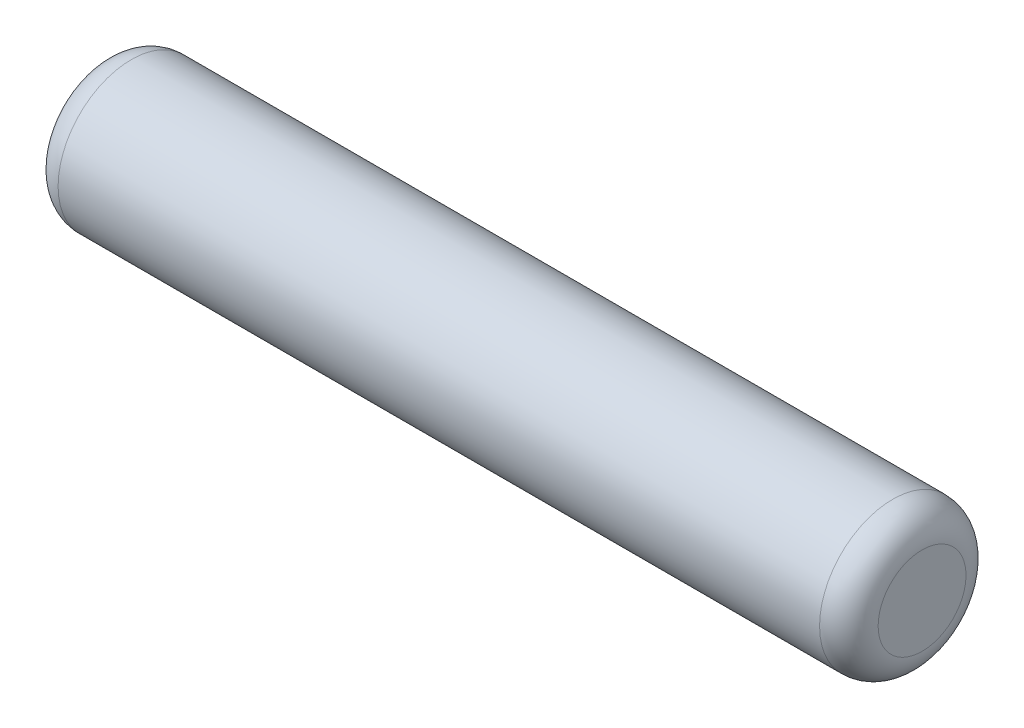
ISO-10303-21;
HEADER;
FILE_DESCRIPTION(('STEP AP214'),'2;1');
FILE_NAME('part.step','',(''),(''),'','','');
FILE_SCHEMA(('AUTOMOTIVE_DESIGN { 1 0 10303 214 1 1 1 1 }'));
ENDSEC;
DATA;
#1=APPLICATION_CONTEXT('core data for automotive mechanical design processes');
#2=APPLICATION_PROTOCOL_DEFINITION('international standard','automotive_design',2000,#1);
#3=PRODUCT_CONTEXT('',#1,'mechanical');
#4=PRODUCT('Part','Part','',(#3));
#5=PRODUCT_RELATED_PRODUCT_CATEGORY('part','',(#4));
#6=PRODUCT_DEFINITION_FORMATION('','',#4);
#7=PRODUCT_DEFINITION_CONTEXT('part definition',#1,'design');
#8=PRODUCT_DEFINITION('design','',#6,#7);
#9=PRODUCT_DEFINITION_SHAPE('','',#8);
#10=(LENGTH_UNIT() NAMED_UNIT(*) SI_UNIT(.MILLI.,.METRE.));
#11=(NAMED_UNIT(*) PLANE_ANGLE_UNIT() SI_UNIT($,.RADIAN.));
#12=(NAMED_UNIT(*) SI_UNIT($,.STERADIAN.) SOLID_ANGLE_UNIT());
#13=UNCERTAINTY_MEASURE_WITH_UNIT(LENGTH_MEASURE(1.E-05),#10,'distance_accuracy_value','');
#14=(GEOMETRIC_REPRESENTATION_CONTEXT(3) GLOBAL_UNCERTAINTY_ASSIGNED_CONTEXT((#13)) GLOBAL_UNIT_ASSIGNED_CONTEXT((#10,
#11,#12)) REPRESENTATION_CONTEXT('',''));
#15=CARTESIAN_POINT('',(0.,0.,0.));
#16=DIRECTION('',(0.,0.,1.));
#17=DIRECTION('',(1.,0.,0.));
#18=AXIS2_PLACEMENT_3D('',#15,#16,#17);
#19=CARTESIAN_POINT('',(-14.,0.,0.));
#20=DIRECTION('',(1.,0.,0.));
#21=DIRECTION('',(0.,0.,-1.));
#22=AXIS2_PLACEMENT_3D('',#19,#20,#21);
#23=PLANE('',#22);
#24=CARTESIAN_POINT('',(-14.,0.,0.));
#25=DIRECTION('',(-1.,0.,0.));
#26=DIRECTION('',(0.,0.,1.));
#27=AXIS2_PLACEMENT_3D('',#24,#25,#26);
#28=CIRCLE('',#27,1.5);
#29=CARTESIAN_POINT('',(-14.,0.,1.5));
#30=VERTEX_POINT('',#29);
#31=EDGE_CURVE('E10',#30,#30,#28,.T.);
#32=ORIENTED_EDGE('',*,*,#31,.T.);
#33=EDGE_LOOP('',(#32));
#34=FACE_BOUND('',#33,.T.);
#35=ADVANCED_FACE('F30',(#34),#23,.F.);
#36=CARTESIAN_POINT('',(-13.,0.,0.));
#37=DIRECTION('',(-1.,0.,0.));
#38=DIRECTION('',(0.,0.,1.));
#39=AXIS2_PLACEMENT_3D('',#36,#37,#38);
#40=TOROIDAL_SURFACE('',#39,1.5,0.999999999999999);
#41=ORIENTED_EDGE('',*,*,#31,.F.);
#42=EDGE_LOOP('',(#41));
#43=FACE_BOUND('',#42,.T.);
#44=CARTESIAN_POINT('',(-13.,0.,0.));
#45=DIRECTION('',(-1.,0.,0.));
#46=DIRECTION('',(0.,0.,1.));
#47=AXIS2_PLACEMENT_3D('',#44,#45,#46);
#48=CIRCLE('',#47,2.5);
#49=CARTESIAN_POINT('',(-13.,0.,2.5));
#50=VERTEX_POINT('',#49);
#51=EDGE_CURVE('E36',#50,#50,#48,.T.);
#52=ORIENTED_EDGE('',*,*,#51,.T.);
#53=EDGE_LOOP('',(#52));
#54=FACE_BOUND('',#53,.T.);
#55=ADVANCED_FACE('F62',(#43,#54),#40,.T.);
#56=CARTESIAN_POINT('',(-16.3297886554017,0.,0.));
#57=DIRECTION('',(-1.,0.,0.));
#58=DIRECTION('',(0.,0.,1.));
#59=AXIS2_PLACEMENT_3D('',#56,#57,#58);
#60=CYLINDRICAL_SURFACE('',#59,2.5);
#61=ORIENTED_EDGE('',*,*,#51,.F.);
#62=EDGE_LOOP('',(#61));
#63=FACE_BOUND('',#62,.T.);
#64=CARTESIAN_POINT('',(13.,0.,0.));
#65=DIRECTION('',(-1.,0.,0.));
#66=DIRECTION('',(0.,0.,1.));
#67=AXIS2_PLACEMENT_3D('',#64,#65,#66);
#68=CIRCLE('',#67,2.5);
#69=CARTESIAN_POINT('',(13.,0.,2.5));
#70=VERTEX_POINT('',#69);
#71=EDGE_CURVE('E40',#70,#70,#68,.T.);
#72=ORIENTED_EDGE('',*,*,#71,.T.);
#73=EDGE_LOOP('',(#72));
#74=FACE_BOUND('',#73,.T.);
#75=ADVANCED_FACE('F58',(#63,#74),#60,.T.);
#76=CARTESIAN_POINT('',(13.,0.,0.));
#77=DIRECTION('',(-1.,0.,0.));
#78=DIRECTION('',(0.,0.,1.));
#79=AXIS2_PLACEMENT_3D('',#76,#77,#78);
#80=TOROIDAL_SURFACE('',#79,1.5,0.999999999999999);
#81=ORIENTED_EDGE('',*,*,#71,.F.);
#82=EDGE_LOOP('',(#81));
#83=FACE_BOUND('',#82,.T.);
#84=CARTESIAN_POINT('',(14.,0.,0.));
#85=DIRECTION('',(-1.,0.,0.));
#86=DIRECTION('',(0.,0.,1.));
#87=AXIS2_PLACEMENT_3D('',#84,#85,#86);
#88=CIRCLE('',#87,1.5);
#89=CARTESIAN_POINT('',(14.,0.,1.5));
#90=VERTEX_POINT('',#89);
#91=EDGE_CURVE('E44',#90,#90,#88,.T.);
#92=ORIENTED_EDGE('',*,*,#91,.T.);
#93=EDGE_LOOP('',(#92));
#94=FACE_BOUND('',#93,.T.);
#95=ADVANCED_FACE('F50',(#83,#94),#80,.T.);
#96=CARTESIAN_POINT('',(14.,1.5,0.));
#97=DIRECTION('',(-1.,0.,0.));
#98=DIRECTION('',(0.,0.,1.));
#99=AXIS2_PLACEMENT_3D('',#96,#97,#98);
#100=PLANE('',#99);
#101=ORIENTED_EDGE('',*,*,#91,.F.);
#102=EDGE_LOOP('',(#101));
#103=FACE_BOUND('',#102,.T.);
#104=ADVANCED_FACE('F52',(#103),#100,.F.);
#105=CLOSED_SHELL('',(#35,#55,#75,#95,#104));
#106=MANIFOLD_SOLID_BREP('B2',#105);
#107=ADVANCED_BREP_SHAPE_REPRESENTATION('',(#18,#106),#14);
#108=SHAPE_DEFINITION_REPRESENTATION(#9,#107);
ENDSEC;
END-ISO-10303-21;
